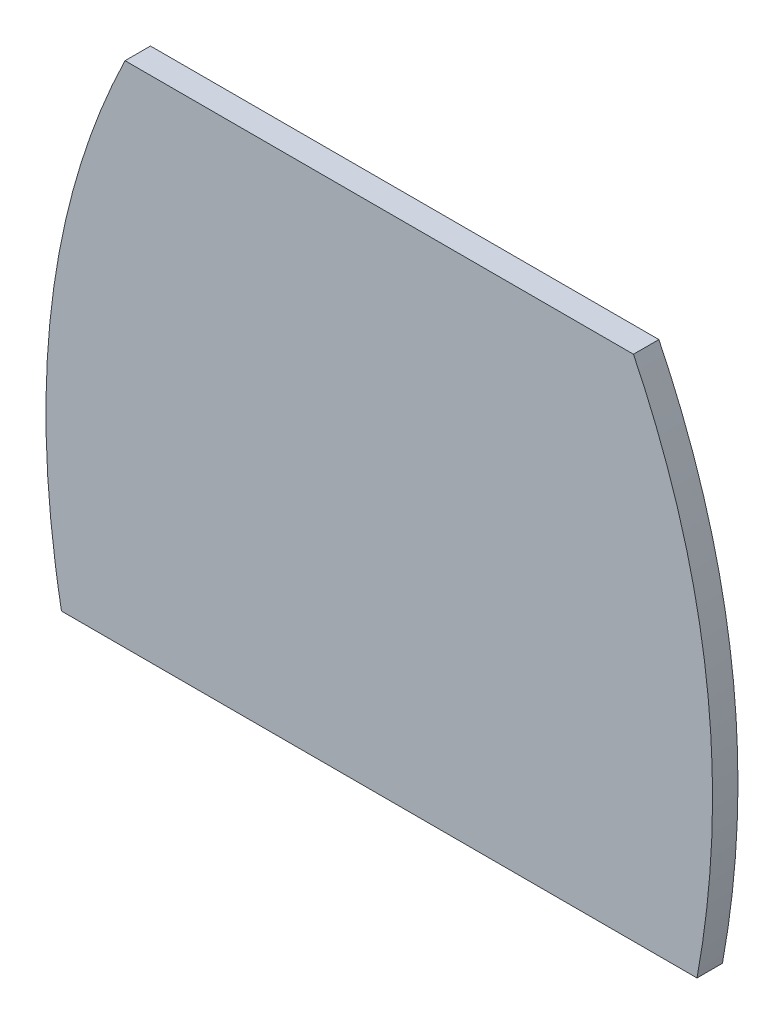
from build123d import *

# Parameters (mm, degrees)
BOSS_EXTRUDE1_DEPTH = 2


with BuildPart() as part:
    # Sketch1 → Boss-Extrude1 (new body)
    with BuildSketch(Plane.XY):
        with BuildLine():
            Line((-19.288443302, 0), (30.711556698, 0))
            add(Edge.make_bspline(
                [(30.711556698, 0), (34.689244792, 21.536950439), (25.711556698, 40)],
                knots=[0, 0, 0, 1, 1, 1], degree=2))
            Line((25.711556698, 40), (-14.288443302, 40))
            add(Edge.make_bspline(
                [(-19.288443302, 0), (-23.266131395, 21.536950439), (-14.288443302, 40)],
                knots=[0, 0, 0, 1, 1, 1], degree=2))
        make_face()
    extrude(amount=BOSS_EXTRUDE1_DEPTH)


solid = part.part
